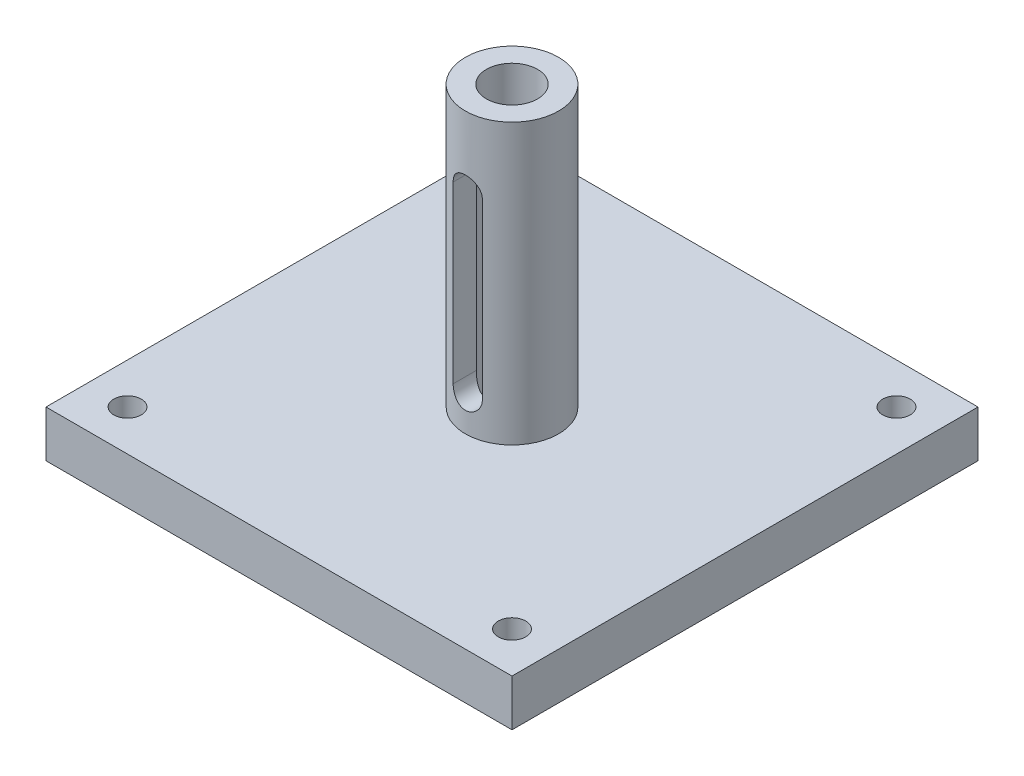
ISO-10303-21;
HEADER;
FILE_DESCRIPTION(('STEP AP214'),'2;1');
FILE_NAME('part.step','',(''),(''),'','','');
FILE_SCHEMA(('AUTOMOTIVE_DESIGN { 1 0 10303 214 1 1 1 1 }'));
ENDSEC;
DATA;
#1=APPLICATION_CONTEXT('core data for automotive mechanical design processes');
#2=APPLICATION_PROTOCOL_DEFINITION('international standard','automotive_design',2000,#1);
#3=PRODUCT_CONTEXT('',#1,'mechanical');
#4=PRODUCT('Part','Part','',(#3));
#5=PRODUCT_RELATED_PRODUCT_CATEGORY('part','',(#4));
#6=PRODUCT_DEFINITION_FORMATION('','',#4);
#7=PRODUCT_DEFINITION_CONTEXT('part definition',#1,'design');
#8=PRODUCT_DEFINITION('design','',#6,#7);
#9=PRODUCT_DEFINITION_SHAPE('','',#8);
#10=(LENGTH_UNIT() NAMED_UNIT(*) SI_UNIT(.MILLI.,.METRE.));
#11=(NAMED_UNIT(*) PLANE_ANGLE_UNIT() SI_UNIT($,.RADIAN.));
#12=(NAMED_UNIT(*) SI_UNIT($,.STERADIAN.) SOLID_ANGLE_UNIT());
#13=UNCERTAINTY_MEASURE_WITH_UNIT(LENGTH_MEASURE(1.E-05),#10,'distance_accuracy_value','');
#14=(GEOMETRIC_REPRESENTATION_CONTEXT(3) GLOBAL_UNCERTAINTY_ASSIGNED_CONTEXT((#13)) GLOBAL_UNIT_ASSIGNED_CONTEXT((#10,
#11,#12)) REPRESENTATION_CONTEXT('',''));
#15=CARTESIAN_POINT('',(0.,0.,0.));
#16=DIRECTION('',(0.,0.,1.));
#17=DIRECTION('',(1.,0.,0.));
#18=AXIS2_PLACEMENT_3D('',#15,#16,#17);
#19=CARTESIAN_POINT('',(25.4,5.08,25.4));
#20=DIRECTION('',(-1.,0.,0.));
#21=DIRECTION('',(0.,0.,1.));
#22=AXIS2_PLACEMENT_3D('',#19,#20,#21);
#23=PLANE('',#22);
#24=DIRECTION('',(0.,0.,-1.));
#25=VECTOR('',#24,1.);
#26=CARTESIAN_POINT('',(25.4,0.,25.4));
#27=LINE('',#26,#25);
#28=CARTESIAN_POINT('',(25.4,0.,25.4));
#29=VERTEX_POINT('',#28);
#30=CARTESIAN_POINT('',(25.4,0.,-25.4));
#31=VERTEX_POINT('',#30);
#32=EDGE_CURVE('E273',#29,#31,#27,.T.);
#33=ORIENTED_EDGE('',*,*,#32,.T.);
#34=DIRECTION('',(0.,-1.,0.));
#35=VECTOR('',#34,1.);
#36=CARTESIAN_POINT('',(25.4,5.08,-25.4));
#37=LINE('',#36,#35);
#38=CARTESIAN_POINT('',(25.4,5.08,-25.4));
#39=VERTEX_POINT('',#38);
#40=EDGE_CURVE('E251',#39,#31,#37,.T.);
#41=ORIENTED_EDGE('',*,*,#40,.F.);
#42=DIRECTION('',(0.,0.,-1.));
#43=VECTOR('',#42,1.);
#44=CARTESIAN_POINT('',(25.4,5.08,25.4));
#45=LINE('',#44,#43);
#46=CARTESIAN_POINT('',(25.4,5.08,25.4));
#47=VERTEX_POINT('',#46);
#48=EDGE_CURVE('E268',#47,#39,#45,.T.);
#49=ORIENTED_EDGE('',*,*,#48,.F.);
#50=DIRECTION('',(0.,-1.,0.));
#51=VECTOR('',#50,1.);
#52=CARTESIAN_POINT('',(25.4,5.08,25.4));
#53=LINE('',#52,#51);
#54=EDGE_CURVE('E262',#47,#29,#53,.T.);
#55=ORIENTED_EDGE('',*,*,#54,.T.);
#56=EDGE_LOOP('',(#33,#41,#49,#55));
#57=FACE_BOUND('',#56,.T.);
#58=ADVANCED_FACE('F39',(#57),#23,.F.);
#59=CARTESIAN_POINT('',(-25.4,5.08,-25.4));
#60=DIRECTION('',(0.,0.,1.));
#61=DIRECTION('',(1.,0.,0.));
#62=AXIS2_PLACEMENT_3D('',#59,#60,#61);
#63=PLANE('',#62);
#64=DIRECTION('',(-1.,0.,0.));
#65=VECTOR('',#64,1.);
#66=CARTESIAN_POINT('',(-25.4,0.,-25.4));
#67=LINE('',#66,#65);
#68=CARTESIAN_POINT('',(-25.4,0.,-25.4));
#69=VERTEX_POINT('',#68);
#70=EDGE_CURVE('E271',#31,#69,#67,.T.);
#71=ORIENTED_EDGE('',*,*,#70,.T.);
#72=DIRECTION('',(0.,-1.,0.));
#73=VECTOR('',#72,1.);
#74=CARTESIAN_POINT('',(-25.4,5.08,-25.4));
#75=LINE('',#74,#73);
#76=CARTESIAN_POINT('',(-25.4,5.08,-25.4));
#77=VERTEX_POINT('',#76);
#78=EDGE_CURVE('E256',#77,#69,#75,.T.);
#79=ORIENTED_EDGE('',*,*,#78,.F.);
#80=DIRECTION('',(-1.,0.,0.));
#81=VECTOR('',#80,1.);
#82=CARTESIAN_POINT('',(-25.4,5.08,-25.4));
#83=LINE('',#82,#81);
#84=EDGE_CURVE('E280',#39,#77,#83,.T.);
#85=ORIENTED_EDGE('',*,*,#84,.F.);
#86=ORIENTED_EDGE('',*,*,#40,.T.);
#87=EDGE_LOOP('',(#71,#79,#85,#86));
#88=FACE_BOUND('',#87,.T.);
#89=ADVANCED_FACE('F302',(#88),#63,.F.);
#90=CARTESIAN_POINT('',(-25.4,5.08,25.4));
#91=DIRECTION('',(1.,0.,0.));
#92=DIRECTION('',(0.,0.,-1.));
#93=AXIS2_PLACEMENT_3D('',#90,#91,#92);
#94=PLANE('',#93);
#95=DIRECTION('',(0.,0.,1.));
#96=VECTOR('',#95,1.);
#97=CARTESIAN_POINT('',(-25.4,0.,25.4));
#98=LINE('',#97,#96);
#99=CARTESIAN_POINT('',(-25.4,0.,25.4));
#100=VERTEX_POINT('',#99);
#101=EDGE_CURVE('E269',#69,#100,#98,.T.);
#102=ORIENTED_EDGE('',*,*,#101,.T.);
#103=DIRECTION('',(0.,-1.,0.));
#104=VECTOR('',#103,1.);
#105=CARTESIAN_POINT('',(-25.4,5.08,25.4));
#106=LINE('',#105,#104);
#107=CARTESIAN_POINT('',(-25.4,5.08,25.4));
#108=VERTEX_POINT('',#107);
#109=EDGE_CURVE('E259',#108,#100,#106,.T.);
#110=ORIENTED_EDGE('',*,*,#109,.F.);
#111=DIRECTION('',(0.,0.,1.));
#112=VECTOR('',#111,1.);
#113=CARTESIAN_POINT('',(-25.4,5.08,25.4));
#114=LINE('',#113,#112);
#115=EDGE_CURVE('E278',#77,#108,#114,.T.);
#116=ORIENTED_EDGE('',*,*,#115,.F.);
#117=ORIENTED_EDGE('',*,*,#78,.T.);
#118=EDGE_LOOP('',(#102,#110,#116,#117));
#119=FACE_BOUND('',#118,.T.);
#120=ADVANCED_FACE('F307',(#119),#94,.F.);
#121=CARTESIAN_POINT('',(-25.4,5.08,25.4));
#122=DIRECTION('',(0.,0.,-1.));
#123=DIRECTION('',(-1.,0.,0.));
#124=AXIS2_PLACEMENT_3D('',#121,#122,#123);
#125=PLANE('',#124);
#126=DIRECTION('',(1.,0.,0.));
#127=VECTOR('',#126,1.);
#128=CARTESIAN_POINT('',(-25.4,0.,25.4));
#129=LINE('',#128,#127);
#130=EDGE_CURVE('E266',#100,#29,#129,.T.);
#131=ORIENTED_EDGE('',*,*,#130,.T.);
#132=ORIENTED_EDGE('',*,*,#54,.F.);
#133=DIRECTION('',(1.,0.,0.));
#134=VECTOR('',#133,1.);
#135=CARTESIAN_POINT('',(-25.4,5.08,25.4));
#136=LINE('',#135,#134);
#137=EDGE_CURVE('E265',#108,#47,#136,.T.);
#138=ORIENTED_EDGE('',*,*,#137,.F.);
#139=ORIENTED_EDGE('',*,*,#109,.T.);
#140=EDGE_LOOP('',(#131,#132,#138,#139));
#141=FACE_BOUND('',#140,.T.);
#142=ADVANCED_FACE('F322',(#141),#125,.F.);
#143=CARTESIAN_POINT('',(0.,5.08,0.));
#144=DIRECTION('',(0.,-1.,0.));
#145=DIRECTION('',(0.,0.,-1.));
#146=AXIS2_PLACEMENT_3D('',#143,#144,#145);
#147=PLANE('',#146);
#148=CARTESIAN_POINT('',(20.955,5.08,-20.955));
#149=DIRECTION('',(0.,1.,0.));
#150=DIRECTION('',(0.,0.,1.));
#151=AXIS2_PLACEMENT_3D('',#148,#149,#150);
#152=CIRCLE('',#151,1.49987);
#153=CARTESIAN_POINT('',(20.955,5.08,-19.45513));
#154=VERTEX_POINT('',#153);
#155=EDGE_CURVE('E523',#154,#154,#152,.T.);
#156=ORIENTED_EDGE('',*,*,#155,.F.);
#157=EDGE_LOOP('',(#156));
#158=FACE_BOUND('',#157,.T.);
#159=CARTESIAN_POINT('',(-20.955,5.08,20.955));
#160=DIRECTION('',(0.,1.,0.));
#161=DIRECTION('',(0.,0.,1.));
#162=AXIS2_PLACEMENT_3D('',#159,#160,#161);
#163=CIRCLE('',#162,1.49987);
#164=CARTESIAN_POINT('',(-20.955,5.08,22.45487));
#165=VERTEX_POINT('',#164);
#166=EDGE_CURVE('E528',#165,#165,#163,.T.);
#167=ORIENTED_EDGE('',*,*,#166,.F.);
#168=EDGE_LOOP('',(#167));
#169=FACE_BOUND('',#168,.T.);
#170=CARTESIAN_POINT('',(20.955,5.08,20.955));
#171=DIRECTION('',(0.,1.,0.));
#172=DIRECTION('',(0.,0.,1.));
#173=AXIS2_PLACEMENT_3D('',#170,#171,#172);
#174=CIRCLE('',#173,1.49987);
#175=CARTESIAN_POINT('',(20.955,5.08,22.45487));
#176=VERTEX_POINT('',#175);
#177=EDGE_CURVE('E544',#176,#176,#174,.T.);
#178=ORIENTED_EDGE('',*,*,#177,.F.);
#179=EDGE_LOOP('',(#178));
#180=FACE_BOUND('',#179,.T.);
#181=CARTESIAN_POINT('',(-20.955,5.08,-20.955));
#182=DIRECTION('',(0.,1.,0.));
#183=DIRECTION('',(0.,0.,1.));
#184=AXIS2_PLACEMENT_3D('',#181,#182,#183);
#185=CIRCLE('',#184,1.49987);
#186=CARTESIAN_POINT('',(-20.955,5.08,-19.45513));
#187=VERTEX_POINT('',#186);
#188=EDGE_CURVE('E357',#187,#187,#185,.T.);
#189=ORIENTED_EDGE('',*,*,#188,.F.);
#190=EDGE_LOOP('',(#189));
#191=FACE_BOUND('',#190,.T.);
#192=CARTESIAN_POINT('',(0.,5.08,0.));
#193=DIRECTION('',(0.,-1.,0.));
#194=DIRECTION('',(0.,0.,-1.));
#195=AXIS2_PLACEMENT_3D('',#192,#193,#194);
#196=CIRCLE('',#195,5.08);
#197=CARTESIAN_POINT('',(0.,5.08,-5.08));
#198=VERTEX_POINT('',#197);
#199=EDGE_CURVE('E249',#198,#198,#196,.F.);
#200=ORIENTED_EDGE('',*,*,#199,.F.);
#201=EDGE_LOOP('',(#200));
#202=FACE_BOUND('',#201,.T.);
#203=ORIENTED_EDGE('',*,*,#48,.T.);
#204=ORIENTED_EDGE('',*,*,#84,.T.);
#205=ORIENTED_EDGE('',*,*,#115,.T.);
#206=ORIENTED_EDGE('',*,*,#137,.T.);
#207=EDGE_LOOP('',(#203,#204,#205,#206));
#208=FACE_BOUND('',#207,.T.);
#209=ADVANCED_FACE('F205',(#158,#169,#180,#191,#202,#208),#147,.F.);
#210=CARTESIAN_POINT('',(0.,0.,0.));
#211=DIRECTION('',(0.,-1.,0.));
#212=DIRECTION('',(0.,0.,-1.));
#213=AXIS2_PLACEMENT_3D('',#210,#211,#212);
#214=PLANE('',#213);
#215=CARTESIAN_POINT('',(20.955,0.,-20.955));
#216=DIRECTION('',(0.,1.,0.));
#217=DIRECTION('',(0.,0.,1.));
#218=AXIS2_PLACEMENT_3D('',#215,#216,#217);
#219=CIRCLE('',#218,1.49987);
#220=CARTESIAN_POINT('',(20.955,0.,-19.45513));
#221=VERTEX_POINT('',#220);
#222=EDGE_CURVE('E521',#221,#221,#219,.T.);
#223=ORIENTED_EDGE('',*,*,#222,.T.);
#224=EDGE_LOOP('',(#223));
#225=FACE_BOUND('',#224,.T.);
#226=CARTESIAN_POINT('',(-20.955,0.,20.955));
#227=DIRECTION('',(0.,1.,0.));
#228=DIRECTION('',(0.,0.,1.));
#229=AXIS2_PLACEMENT_3D('',#226,#227,#228);
#230=CIRCLE('',#229,1.49987);
#231=CARTESIAN_POINT('',(-20.955,0.,22.45487));
#232=VERTEX_POINT('',#231);
#233=EDGE_CURVE('E524',#232,#232,#230,.T.);
#234=ORIENTED_EDGE('',*,*,#233,.T.);
#235=EDGE_LOOP('',(#234));
#236=FACE_BOUND('',#235,.T.);
#237=CARTESIAN_POINT('',(20.955,0.,20.955));
#238=DIRECTION('',(0.,1.,0.));
#239=DIRECTION('',(0.,0.,1.));
#240=AXIS2_PLACEMENT_3D('',#237,#238,#239);
#241=CIRCLE('',#240,1.49987);
#242=CARTESIAN_POINT('',(20.955,0.,22.45487));
#243=VERTEX_POINT('',#242);
#244=EDGE_CURVE('E533',#243,#243,#241,.T.);
#245=ORIENTED_EDGE('',*,*,#244,.T.);
#246=EDGE_LOOP('',(#245));
#247=FACE_BOUND('',#246,.T.);
#248=CARTESIAN_POINT('',(-20.955,0.,-20.955));
#249=DIRECTION('',(0.,1.,0.));
#250=DIRECTION('',(0.,0.,1.));
#251=AXIS2_PLACEMENT_3D('',#248,#249,#250);
#252=CIRCLE('',#251,1.49987);
#253=CARTESIAN_POINT('',(-20.955,0.,-19.45513));
#254=VERTEX_POINT('',#253);
#255=EDGE_CURVE('E352',#254,#254,#252,.T.);
#256=ORIENTED_EDGE('',*,*,#255,.T.);
#257=EDGE_LOOP('',(#256));
#258=FACE_BOUND('',#257,.T.);
#259=CARTESIAN_POINT('',(0.,0.,0.));
#260=DIRECTION('',(0.,1.,0.));
#261=DIRECTION('',(0.,0.,1.));
#262=AXIS2_PLACEMENT_3D('',#259,#260,#261);
#263=CIRCLE('',#262,1.5875);
#264=CARTESIAN_POINT('',(0.,0.,1.5875));
#265=VERTEX_POINT('',#264);
#266=EDGE_CURVE('E351',#265,#265,#263,.T.);
#267=ORIENTED_EDGE('',*,*,#266,.T.);
#268=EDGE_LOOP('',(#267));
#269=FACE_BOUND('',#268,.T.);
#270=ORIENTED_EDGE('',*,*,#32,.F.);
#271=ORIENTED_EDGE('',*,*,#130,.F.);
#272=ORIENTED_EDGE('',*,*,#101,.F.);
#273=ORIENTED_EDGE('',*,*,#70,.F.);
#274=EDGE_LOOP('',(#270,#271,#272,#273));
#275=FACE_BOUND('',#274,.T.);
#276=ADVANCED_FACE('F295',(#225,#236,#247,#258,#269,#275),#214,.T.);
#277=CARTESIAN_POINT('',(0.,35.56,0.));
#278=DIRECTION('',(0.,1.,0.));
#279=DIRECTION('',(0.,0.,1.));
#280=AXIS2_PLACEMENT_3D('',#277,#278,#279);
#281=PLANE('',#280);
#282=CARTESIAN_POINT('',(0.,35.56,0.));
#283=DIRECTION('',(0.,1.,0.));
#284=DIRECTION('',(0.,0.,1.));
#285=AXIS2_PLACEMENT_3D('',#282,#283,#284);
#286=CIRCLE('',#285,5.08);
#287=CARTESIAN_POINT('',(0.,35.56,5.08));
#288=VERTEX_POINT('',#287);
#289=EDGE_CURVE('E276',#288,#288,#286,.T.);
#290=ORIENTED_EDGE('',*,*,#289,.T.);
#291=EDGE_LOOP('',(#290));
#292=FACE_BOUND('',#291,.T.);
#293=CARTESIAN_POINT('',(0.,35.56,0.));
#294=DIRECTION('',(0.,1.,0.));
#295=DIRECTION('',(0.,0.,1.));
#296=AXIS2_PLACEMENT_3D('',#293,#294,#295);
#297=CIRCLE('',#296,2.794);
#298=CARTESIAN_POINT('',(0.,35.56,2.794));
#299=VERTEX_POINT('',#298);
#300=EDGE_CURVE('E286',#299,#299,#297,.T.);
#301=ORIENTED_EDGE('',*,*,#300,.F.);
#302=EDGE_LOOP('',(#301));
#303=FACE_BOUND('',#302,.T.);
#304=ADVANCED_FACE('F203',(#292,#303),#281,.T.);
#305=CARTESIAN_POINT('',(0.,35.56,0.));
#306=DIRECTION('',(0.,-1.,0.));
#307=DIRECTION('',(0.,0.,-1.));
#308=AXIS2_PLACEMENT_3D('',#305,#306,#307);
#309=CYLINDRICAL_SURFACE('',#308,5.08);
#310=DIRECTION('',(0.,-1.,0.));
#311=VECTOR('',#310,1.);
#312=CARTESIAN_POINT('',(1.5875,35.56,-4.82558221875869));
#313=LINE('',#312,#311);
#314=CARTESIAN_POINT('',(1.5875,8.89,-4.82558221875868));
#315=VERTEX_POINT('',#314);
#316=CARTESIAN_POINT('',(1.5875,27.94,-4.82558221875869));
#317=VERTEX_POINT('',#316);
#318=EDGE_CURVE('E378',#315,#317,#313,.F.);
#319=ORIENTED_EDGE('',*,*,#318,.T.);
#320=CARTESIAN_POINT('',(1.5875,27.94,-4.82558221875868));
#321=CARTESIAN_POINT('',(1.58750100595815,27.9834881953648,-4.82557828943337));
#322=CARTESIAN_POINT('',(1.58571187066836,28.0269543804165,-4.82617083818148));
#323=CARTESIAN_POINT('',(1.57858282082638,28.1135530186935,-4.82850881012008));
#324=CARTESIAN_POINT('',(1.57324376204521,28.1566855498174,-4.83025395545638));
#325=CARTESIAN_POINT('',(1.55199520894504,28.2848746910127,-4.83714223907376));
#326=CARTESIAN_POINT('',(1.53085384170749,28.3690365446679,-4.84393879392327));
#327=CARTESIAN_POINT('',(1.47536034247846,28.5323846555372,-4.86112567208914));
#328=CARTESIAN_POINT('',(1.4410137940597,28.6115729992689,-4.87151447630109));
#329=CARTESIAN_POINT('',(1.36014702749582,28.7631253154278,-4.89470782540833));
#330=CARTESIAN_POINT('',(1.31362048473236,28.8354857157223,-4.90751362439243));
#331=CARTESIAN_POINT('',(1.20801981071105,28.9737530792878,-4.93458638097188));
#332=CARTESIAN_POINT('',(1.14860184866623,29.0393909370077,-4.94888629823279));
#333=CARTESIAN_POINT('',(1.01963707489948,29.1599548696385,-4.97705647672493));
#334=CARTESIAN_POINT('',(0.950088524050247,29.2148791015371,-4.99092666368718));
#335=CARTESIAN_POINT('',(0.800893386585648,29.3136471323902,-5.01705339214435));
#336=CARTESIAN_POINT('',(0.721053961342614,29.3572121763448,-5.0292663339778));
#337=CARTESIAN_POINT('',(0.554737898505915,29.4301887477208,-5.05031476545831));
#338=CARTESIAN_POINT('',(0.468263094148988,29.4596041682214,-5.05915118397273));
#339=CARTESIAN_POINT('',(0.293960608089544,29.5025457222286,-5.07221706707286));
#340=CARTESIAN_POINT('',(0.206257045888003,29.5165342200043,-5.0765802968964));
#341=CARTESIAN_POINT('',(0.0296446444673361,29.5296899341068,-5.08068067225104));
#342=CARTESIAN_POINT('',(-0.0592639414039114,29.5288602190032,-5.08041877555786));
#343=CARTESIAN_POINT('',(-0.232505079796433,29.5127066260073,-5.07539136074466));
#344=CARTESIAN_POINT('',(-0.31688963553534,29.4978842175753,-5.07078166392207));
#345=CARTESIAN_POINT('',(-0.481906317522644,29.4549890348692,-5.0577683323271));
#346=CARTESIAN_POINT('',(-0.562538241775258,29.4269155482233,-5.04936449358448));
#347=CARTESIAN_POINT('',(-0.718919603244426,29.3579926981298,-5.02949788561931));
#348=CARTESIAN_POINT('',(-0.794597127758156,29.3169910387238,-5.01799890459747));
#349=CARTESIAN_POINT('',(-0.938152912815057,29.2234980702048,-4.99315374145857));
#350=CARTESIAN_POINT('',(-1.00602927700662,29.1710039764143,-4.97980711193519));
#351=CARTESIAN_POINT('',(-1.1350408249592,29.0534482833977,-4.95203191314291));
#352=CARTESIAN_POINT('',(-1.19577830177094,28.9879548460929,-4.93758143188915));
#353=CARTESIAN_POINT('',(-1.3055380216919,28.8475608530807,-4.90970330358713));
#354=CARTESIAN_POINT('',(-1.35455673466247,28.7726574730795,-4.89627596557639));
#355=CARTESIAN_POINT('',(-1.43995728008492,28.6144316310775,-4.87185035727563));
#356=CARTESIAN_POINT('',(-1.47618467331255,28.5310209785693,-4.86088232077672));
#357=CARTESIAN_POINT('',(-1.53391179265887,28.3589019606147,-4.84297872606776));
#358=CARTESIAN_POINT('',(-1.55543427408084,28.270202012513,-4.83603693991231));
#359=CARTESIAN_POINT('',(-1.57529747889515,28.1405488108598,-4.8295828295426));
#360=CARTESIAN_POINT('',(-1.57987242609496,28.1005629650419,-4.82808623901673));
#361=CARTESIAN_POINT('',(-1.58597120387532,28.0203916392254,-4.82608561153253));
#362=CARTESIAN_POINT('',(-1.58749934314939,27.9802065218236,-4.8255801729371));
#363=CARTESIAN_POINT('',(-1.5875,27.94,-4.82558221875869));
#364=B_SPLINE_CURVE_WITH_KNOTS('',3,(#320,#321,#322,#323,#324,#325,#326,#327,#328,#329,#330,
#331,#332,#333,#334,#335,#336,#337,#338,#339,#340,#341,#342,#343,#344,#345,#346,#347,#348,#349,
#350,#351,#352,#353,#354,#355,#356,#357,#358,#359,#360,#361,#362,#363),.UNSPECIFIED.,.F.,.F.,(4,
2,2,2,2,2,2,2,2,2,2,2,2,2,2,2,2,2,2,2,2,4),(0.,0.130380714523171,0.260730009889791,
0.520499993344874,0.780160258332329,1.03995562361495,1.30779302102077,1.57567645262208,
1.84961966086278,2.12348745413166,2.38890301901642,2.65426362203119,2.91046138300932,
3.16667291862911,3.42602313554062,3.68543626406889,3.95563699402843,4.22591901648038,
4.49936093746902,4.77237875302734,4.89309476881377,5.01363995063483),.UNSPECIFIED.);
#365=CARTESIAN_POINT('',(-1.5875,27.94,-4.82558221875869));
#366=VERTEX_POINT('',#365);
#367=EDGE_CURVE('E212',#317,#366,#364,.T.);
#368=ORIENTED_EDGE('',*,*,#367,.T.);
#369=DIRECTION('',(0.,-1.,0.));
#370=VECTOR('',#369,1.);
#371=CARTESIAN_POINT('',(-1.5875,35.56,-4.82558221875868));
#372=LINE('',#371,#370);
#373=CARTESIAN_POINT('',(-1.5875,8.89,-4.82558221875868));
#374=VERTEX_POINT('',#373);
#375=EDGE_CURVE('E192',#366,#374,#372,.T.);
#376=ORIENTED_EDGE('',*,*,#375,.T.);
#377=CARTESIAN_POINT('',(-1.5875,8.89,-4.82558221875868));
#378=CARTESIAN_POINT('',(-1.58750100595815,8.84651180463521,-4.82557828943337));
#379=CARTESIAN_POINT('',(-1.58571187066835,8.80304561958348,-4.82617083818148));
#380=CARTESIAN_POINT('',(-1.57858282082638,8.71644698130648,-4.82850881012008));
#381=CARTESIAN_POINT('',(-1.57324376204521,8.67331445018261,-4.83025395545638));
#382=CARTESIAN_POINT('',(-1.55199520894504,8.54512530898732,-4.83714223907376));
#383=CARTESIAN_POINT('',(-1.53085384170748,8.46096345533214,-4.84393879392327));
#384=CARTESIAN_POINT('',(-1.47536034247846,8.29761534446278,-4.86112567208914));
#385=CARTESIAN_POINT('',(-1.44101379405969,8.21842700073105,-4.87151447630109));
#386=CARTESIAN_POINT('',(-1.36014702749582,8.06687468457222,-4.89470782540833));
#387=CARTESIAN_POINT('',(-1.31362048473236,7.99451428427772,-4.90751362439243));
#388=CARTESIAN_POINT('',(-1.20801981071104,7.85624692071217,-4.93458638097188));
#389=CARTESIAN_POINT('',(-1.14860184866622,7.7906090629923,-4.94888629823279));
#390=CARTESIAN_POINT('',(-1.01963707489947,7.6700451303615,-4.97705647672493));
#391=CARTESIAN_POINT('',(-0.95008852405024,7.61512089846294,-4.99092666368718));
#392=CARTESIAN_POINT('',(-0.800893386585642,7.51635286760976,-5.01705339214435));
#393=CARTESIAN_POINT('',(-0.721053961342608,7.47278782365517,-5.0292663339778));
#394=CARTESIAN_POINT('',(-0.554737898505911,7.39981125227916,-5.05031476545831));
#395=CARTESIAN_POINT('',(-0.468263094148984,7.37039583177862,-5.05915118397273));
#396=CARTESIAN_POINT('',(-0.293960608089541,7.32745427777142,-5.07221706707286));
#397=CARTESIAN_POINT('',(-0.206257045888,7.31346577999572,-5.0765802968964));
#398=CARTESIAN_POINT('',(-0.0296446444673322,7.30031006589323,-5.08068067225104));
#399=CARTESIAN_POINT('',(0.0592639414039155,7.30113978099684,-5.08041877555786));
#400=CARTESIAN_POINT('',(0.232505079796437,7.31729337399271,-5.07539136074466));
#401=CARTESIAN_POINT('',(0.316889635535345,7.33211578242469,-5.07078166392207));
#402=CARTESIAN_POINT('',(0.481906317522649,7.37501096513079,-5.0577683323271));
#403=CARTESIAN_POINT('',(0.562538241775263,7.40308445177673,-5.04936449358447));
#404=CARTESIAN_POINT('',(0.718919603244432,7.4720073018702,-5.02949788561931));
#405=CARTESIAN_POINT('',(0.794597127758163,7.51300896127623,-5.01799890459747));
#406=CARTESIAN_POINT('',(0.938152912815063,7.60650192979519,-4.99315374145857));
#407=CARTESIAN_POINT('',(1.00602927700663,7.65899602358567,-4.97980711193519));
#408=CARTESIAN_POINT('',(1.13504082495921,7.77655171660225,-4.95203191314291));
#409=CARTESIAN_POINT('',(1.19577830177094,7.84204515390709,-4.93758143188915));
#410=CARTESIAN_POINT('',(1.3055380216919,7.98243914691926,-4.90970330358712));
#411=CARTESIAN_POINT('',(1.35455673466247,8.05734252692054,-4.89627596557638));
#412=CARTESIAN_POINT('',(1.43995728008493,8.21556836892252,-4.87185035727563));
#413=CARTESIAN_POINT('',(1.47618467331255,8.29897902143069,-4.86088232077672));
#414=CARTESIAN_POINT('',(1.53391179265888,8.4710980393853,-4.84297872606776));
#415=CARTESIAN_POINT('',(1.55543427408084,8.55979798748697,-4.83603693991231));
#416=CARTESIAN_POINT('',(1.57529747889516,8.68945118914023,-4.8295828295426));
#417=CARTESIAN_POINT('',(1.57987242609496,8.72943703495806,-4.82808623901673));
#418=CARTESIAN_POINT('',(1.58597120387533,8.8096083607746,-4.82608561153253));
#419=CARTESIAN_POINT('',(1.5874993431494,8.84979347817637,-4.8255801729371));
#420=CARTESIAN_POINT('',(1.5875,8.89,-4.82558221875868));
#421=B_SPLINE_CURVE_WITH_KNOTS('',3,(#377,#378,#379,#380,#381,#382,#383,#384,#385,#386,#387,
#388,#389,#390,#391,#392,#393,#394,#395,#396,#397,#398,#399,#400,#401,#402,#403,#404,#405,#406,
#407,#408,#409,#410,#411,#412,#413,#414,#415,#416,#417,#418,#419,#420),.UNSPECIFIED.,.F.,.F.,(4,
2,2,2,2,2,2,2,2,2,2,2,2,2,2,2,2,2,2,2,2,4),(0.,0.130380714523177,0.260730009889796,
0.520499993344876,0.780160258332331,1.03995562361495,1.30779302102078,1.57567645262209,
1.84961966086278,2.12348745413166,2.38890301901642,2.65426362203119,2.91046138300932,
3.16667291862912,3.42602313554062,3.68543626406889,3.95563699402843,4.22591901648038,
4.49936093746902,4.77237875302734,4.89309476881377,5.01363995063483),.UNSPECIFIED.);
#422=EDGE_CURVE('E146',#374,#315,#421,.T.);
#423=ORIENTED_EDGE('',*,*,#422,.T.);
#424=EDGE_LOOP('',(#319,#368,#376,#423));
#425=FACE_BOUND('',#424,.T.);
#426=DIRECTION('',(0.,-1.,0.));
#427=VECTOR('',#426,1.);
#428=CARTESIAN_POINT('',(-1.5875,35.56,4.82558221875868));
#429=LINE('',#428,#427);
#430=CARTESIAN_POINT('',(-1.5875,8.89,4.82558221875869));
#431=VERTEX_POINT('',#430);
#432=CARTESIAN_POINT('',(-1.5875,27.94,4.82558221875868));
#433=VERTEX_POINT('',#432);
#434=EDGE_CURVE('E367',#431,#433,#429,.F.);
#435=ORIENTED_EDGE('',*,*,#434,.T.);
#436=CARTESIAN_POINT('',(-1.5875,27.94,4.82558221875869));
#437=CARTESIAN_POINT('',(-1.58750100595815,27.9834881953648,4.82557828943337));
#438=CARTESIAN_POINT('',(-1.58571187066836,28.0269543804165,4.82617083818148));
#439=CARTESIAN_POINT('',(-1.57858282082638,28.1135530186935,4.82850881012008));
#440=CARTESIAN_POINT('',(-1.57324376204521,28.1566855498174,4.83025395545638));
#441=CARTESIAN_POINT('',(-1.55199520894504,28.2848746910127,4.83714223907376));
#442=CARTESIAN_POINT('',(-1.53085384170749,28.3690365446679,4.84393879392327));
#443=CARTESIAN_POINT('',(-1.47536034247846,28.5323846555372,4.86112567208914));
#444=CARTESIAN_POINT('',(-1.44101379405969,28.6115729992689,4.87151447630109));
#445=CARTESIAN_POINT('',(-1.36014702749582,28.7631253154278,4.89470782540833));
#446=CARTESIAN_POINT('',(-1.31362048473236,28.8354857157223,4.90751362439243));
#447=CARTESIAN_POINT('',(-1.20801981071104,28.9737530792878,4.93458638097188));
#448=CARTESIAN_POINT('',(-1.14860184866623,29.0393909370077,4.94888629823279));
#449=CARTESIAN_POINT('',(-1.01963707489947,29.1599548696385,4.97705647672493));
#450=CARTESIAN_POINT('',(-0.950088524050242,29.2148791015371,4.99092666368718));
#451=CARTESIAN_POINT('',(-0.800893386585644,29.3136471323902,5.01705339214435));
#452=CARTESIAN_POINT('',(-0.721053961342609,29.3572121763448,5.0292663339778));
#453=CARTESIAN_POINT('',(-0.554737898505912,29.4301887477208,5.05031476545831));
#454=CARTESIAN_POINT('',(-0.468263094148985,29.4596041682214,5.05915118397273));
#455=CARTESIAN_POINT('',(-0.293960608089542,29.5025457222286,5.07221706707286));
#456=CARTESIAN_POINT('',(-0.206257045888,29.5165342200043,5.0765802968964));
#457=CARTESIAN_POINT('',(-0.0296446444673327,29.5296899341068,5.08068067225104));
#458=CARTESIAN_POINT('',(0.0592639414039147,29.5288602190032,5.08041877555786));
#459=CARTESIAN_POINT('',(0.232505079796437,29.5127066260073,5.07539136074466));
#460=CARTESIAN_POINT('',(0.316889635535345,29.4978842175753,5.07078166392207));
#461=CARTESIAN_POINT('',(0.481906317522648,29.4549890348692,5.0577683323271));
#462=CARTESIAN_POINT('',(0.562538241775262,29.4269155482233,5.04936449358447));
#463=CARTESIAN_POINT('',(0.718919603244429,29.3579926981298,5.02949788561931));
#464=CARTESIAN_POINT('',(0.79459712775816,29.3169910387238,5.01799890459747));
#465=CARTESIAN_POINT('',(0.93815291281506,29.2234980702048,4.99315374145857));
#466=CARTESIAN_POINT('',(1.00602927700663,29.1710039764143,4.97980711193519));
#467=CARTESIAN_POINT('',(1.1350408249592,29.0534482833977,4.95203191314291));
#468=CARTESIAN_POINT('',(1.19577830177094,28.9879548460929,4.93758143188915));
#469=CARTESIAN_POINT('',(1.3055380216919,28.8475608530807,4.90970330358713));
#470=CARTESIAN_POINT('',(1.35455673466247,28.7726574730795,4.89627596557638));
#471=CARTESIAN_POINT('',(1.43995728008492,28.6144316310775,4.87185035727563));
#472=CARTESIAN_POINT('',(1.47618467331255,28.5310209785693,4.86088232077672));
#473=CARTESIAN_POINT('',(1.53391179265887,28.3589019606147,4.84297872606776));
#474=CARTESIAN_POINT('',(1.55543427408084,28.270202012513,4.83603693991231));
#475=CARTESIAN_POINT('',(1.57529747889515,28.1405488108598,4.8295828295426));
#476=CARTESIAN_POINT('',(1.57987242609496,28.1005629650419,4.82808623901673));
#477=CARTESIAN_POINT('',(1.58597120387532,28.0203916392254,4.82608561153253));
#478=CARTESIAN_POINT('',(1.58749934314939,27.9802065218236,4.8255801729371));
#479=CARTESIAN_POINT('',(1.5875,27.94,4.82558221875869));
#480=B_SPLINE_CURVE_WITH_KNOTS('',3,(#436,#437,#438,#439,#440,#441,#442,#443,#444,#445,#446,
#447,#448,#449,#450,#451,#452,#453,#454,#455,#456,#457,#458,#459,#460,#461,#462,#463,#464,#465,
#466,#467,#468,#469,#470,#471,#472,#473,#474,#475,#476,#477,#478,#479),.UNSPECIFIED.,.F.,.F.,(4,
2,2,2,2,2,2,2,2,2,2,2,2,2,2,2,2,2,2,2,2,4),(0.,0.130380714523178,0.260730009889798,
0.520499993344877,0.780160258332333,1.03995562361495,1.30779302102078,1.57567645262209,
1.84961966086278,2.12348745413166,2.38890301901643,2.65426362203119,2.91046138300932,
3.16667291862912,3.42602313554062,3.68543626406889,3.95563699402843,4.22591901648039,
4.49936093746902,4.77237875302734,4.89309476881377,5.01363995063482),.UNSPECIFIED.);
#481=CARTESIAN_POINT('',(1.5875,27.94,4.82558221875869));
#482=VERTEX_POINT('',#481);
#483=EDGE_CURVE('E219',#433,#482,#480,.T.);
#484=ORIENTED_EDGE('',*,*,#483,.T.);
#485=DIRECTION('',(0.,-1.,0.));
#486=VECTOR('',#485,1.);
#487=CARTESIAN_POINT('',(1.5875,35.56,4.82558221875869));
#488=LINE('',#487,#486);
#489=CARTESIAN_POINT('',(1.5875,8.89,4.82558221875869));
#490=VERTEX_POINT('',#489);
#491=EDGE_CURVE('E220',#482,#490,#488,.T.);
#492=ORIENTED_EDGE('',*,*,#491,.T.);
#493=CARTESIAN_POINT('',(1.5875,8.89,4.82558221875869));
#494=CARTESIAN_POINT('',(1.58750100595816,8.84651180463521,4.82557828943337));
#495=CARTESIAN_POINT('',(1.58571187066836,8.80304561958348,4.82617083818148));
#496=CARTESIAN_POINT('',(1.57858282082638,8.71644698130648,4.82850881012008));
#497=CARTESIAN_POINT('',(1.57324376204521,8.67331445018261,4.83025395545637));
#498=CARTESIAN_POINT('',(1.55199520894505,8.54512530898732,4.83714223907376));
#499=CARTESIAN_POINT('',(1.53085384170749,8.46096345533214,4.84393879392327));
#500=CARTESIAN_POINT('',(1.47536034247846,8.29761534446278,4.86112567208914));
#501=CARTESIAN_POINT('',(1.4410137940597,8.21842700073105,4.87151447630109));
#502=CARTESIAN_POINT('',(1.36014702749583,8.06687468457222,4.89470782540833));
#503=CARTESIAN_POINT('',(1.31362048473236,7.99451428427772,4.90751362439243));
#504=CARTESIAN_POINT('',(1.20801981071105,7.85624692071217,4.93458638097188));
#505=CARTESIAN_POINT('',(1.14860184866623,7.7906090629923,4.94888629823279));
#506=CARTESIAN_POINT('',(1.01963707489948,7.6700451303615,4.97705647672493));
#507=CARTESIAN_POINT('',(0.950088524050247,7.61512089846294,4.99092666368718));
#508=CARTESIAN_POINT('',(0.800893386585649,7.51635286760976,5.01705339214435));
#509=CARTESIAN_POINT('',(0.721053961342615,7.47278782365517,5.0292663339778));
#510=CARTESIAN_POINT('',(0.554737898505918,7.39981125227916,5.05031476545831));
#511=CARTESIAN_POINT('',(0.468263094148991,7.37039583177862,5.05915118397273));
#512=CARTESIAN_POINT('',(0.293960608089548,7.32745427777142,5.07221706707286));
#513=CARTESIAN_POINT('',(0.206257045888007,7.31346577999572,5.0765802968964));
#514=CARTESIAN_POINT('',(0.029644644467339,7.30031006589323,5.08068067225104));
#515=CARTESIAN_POINT('',(-0.0592639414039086,7.30113978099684,5.08041877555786));
#516=CARTESIAN_POINT('',(-0.232505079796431,7.31729337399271,5.07539136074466));
#517=CARTESIAN_POINT('',(-0.316889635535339,7.33211578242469,5.07078166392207));
#518=CARTESIAN_POINT('',(-0.481906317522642,7.37501096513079,5.0577683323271));
#519=CARTESIAN_POINT('',(-0.562538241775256,7.40308445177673,5.04936449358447));
#520=CARTESIAN_POINT('',(-0.718919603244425,7.4720073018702,5.02949788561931));
#521=CARTESIAN_POINT('',(-0.794597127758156,7.51300896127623,5.01799890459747));
#522=CARTESIAN_POINT('',(-0.938152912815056,7.60650192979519,4.99315374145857));
#523=CARTESIAN_POINT('',(-1.00602927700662,7.65899602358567,4.97980711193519));
#524=CARTESIAN_POINT('',(-1.1350408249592,7.77655171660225,4.95203191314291));
#525=CARTESIAN_POINT('',(-1.19577830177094,7.84204515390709,4.93758143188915));
#526=CARTESIAN_POINT('',(-1.3055380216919,7.98243914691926,4.90970330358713));
#527=CARTESIAN_POINT('',(-1.35455673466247,8.05734252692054,4.89627596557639));
#528=CARTESIAN_POINT('',(-1.43995728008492,8.21556836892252,4.87185035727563));
#529=CARTESIAN_POINT('',(-1.47618467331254,8.29897902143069,4.86088232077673));
#530=CARTESIAN_POINT('',(-1.53391179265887,8.4710980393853,4.84297872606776));
#531=CARTESIAN_POINT('',(-1.55543427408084,8.55979798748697,4.83603693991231));
#532=CARTESIAN_POINT('',(-1.57529747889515,8.68945118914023,4.8295828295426));
#533=CARTESIAN_POINT('',(-1.57987242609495,8.72943703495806,4.82808623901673));
#534=CARTESIAN_POINT('',(-1.58597120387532,8.8096083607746,4.82608561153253));
#535=CARTESIAN_POINT('',(-1.58749934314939,8.84979347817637,4.8255801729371));
#536=CARTESIAN_POINT('',(-1.5875,8.89,4.82558221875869));
#537=B_SPLINE_CURVE_WITH_KNOTS('',3,(#493,#494,#495,#496,#497,#498,#499,#500,#501,#502,#503,
#504,#505,#506,#507,#508,#509,#510,#511,#512,#513,#514,#515,#516,#517,#518,#519,#520,#521,#522,
#523,#524,#525,#526,#527,#528,#529,#530,#531,#532,#533,#534,#535,#536),.UNSPECIFIED.,.F.,.F.,(4,
2,2,2,2,2,2,2,2,2,2,2,2,2,2,2,2,2,2,2,2,4),(0.,0.130380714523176,0.260730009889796,
0.520499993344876,0.780160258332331,1.03995562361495,1.30779302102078,1.57567645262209,
1.84961966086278,2.12348745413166,2.38890301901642,2.65426362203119,2.91046138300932,
3.16667291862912,3.42602313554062,3.68543626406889,3.95563699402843,4.22591901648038,
4.49936093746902,4.77237875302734,4.89309476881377,5.01363995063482),.UNSPECIFIED.);
#538=EDGE_CURVE('E191',#490,#431,#537,.T.);
#539=ORIENTED_EDGE('',*,*,#538,.T.);
#540=EDGE_LOOP('',(#435,#484,#492,#539));
#541=FACE_BOUND('',#540,.T.);
#542=ORIENTED_EDGE('',*,*,#289,.F.);
#543=EDGE_LOOP('',(#542));
#544=FACE_BOUND('',#543,.T.);
#545=ORIENTED_EDGE('',*,*,#199,.T.);
#546=EDGE_LOOP('',(#545));
#547=FACE_BOUND('',#546,.T.);
#548=ADVANCED_FACE('F199',(#425,#541,#544,#547),#309,.T.);
#549=CARTESIAN_POINT('',(0.,35.56,0.));
#550=DIRECTION('',(0.,-1.,0.));
#551=DIRECTION('',(0.,0.,-1.));
#552=AXIS2_PLACEMENT_3D('',#549,#550,#551);
#553=CYLINDRICAL_SURFACE('',#552,2.794);
#554=CARTESIAN_POINT('',(1.5875,27.94,-2.29919110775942));
#555=CARTESIAN_POINT('',(1.58750415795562,27.9806464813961,-2.29918034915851));
#556=CARTESIAN_POINT('',(1.58593793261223,28.0212681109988,-2.30027026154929));
#557=CARTESIAN_POINT('',(1.57971879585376,28.1021296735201,-2.30454911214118));
#558=CARTESIAN_POINT('',(1.57506848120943,28.1423698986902,-2.30773628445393));
#559=CARTESIAN_POINT('',(1.55666783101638,28.2614802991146,-2.32022584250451));
#560=CARTESIAN_POINT('',(1.53846576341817,28.3394046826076,-2.33245961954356));
#561=CARTESIAN_POINT('',(1.49118593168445,28.4902455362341,-2.36295886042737));
#562=CARTESIAN_POINT('',(1.46214041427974,28.563176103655,-2.38120642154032));
#563=CARTESIAN_POINT('',(1.39416381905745,28.7032405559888,-2.42163337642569));
#564=CARTESIAN_POINT('',(1.35521271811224,28.7703623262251,-2.44382070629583));
#565=CARTESIAN_POINT('',(1.26365959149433,28.9046870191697,-2.49250169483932));
#566=CARTESIAN_POINT('',(1.21003947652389,28.9711209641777,-2.51920181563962));
#567=CARTESIAN_POINT('',(1.09278025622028,29.0946617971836,-2.57223857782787));
#568=CARTESIAN_POINT('',(1.02913785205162,29.1517656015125,-2.59857509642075));
#569=CARTESIAN_POINT('',(0.886385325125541,29.2603202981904,-2.65085911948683));
#570=CARTESIAN_POINT('',(0.806384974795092,29.3107417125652,-2.67653945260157));
#571=CARTESIAN_POINT('',(0.637298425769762,29.3970495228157,-2.7217493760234));
#572=CARTESIAN_POINT('',(0.54821941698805,29.432947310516,-2.74128378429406));
#573=CARTESIAN_POINT('',(0.371763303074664,29.485856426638,-2.77047117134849));
#574=CARTESIAN_POINT('',(0.284921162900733,29.504247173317,-2.7808400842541));
#575=CARTESIAN_POINT('',(0.108822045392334,29.5262434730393,-2.79327063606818));
#576=CARTESIAN_POINT('',(0.0195670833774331,29.5298610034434,-2.7953390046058));
#577=CARTESIAN_POINT('',(-0.148110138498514,29.5225508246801,-2.79119068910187));
#578=CARTESIAN_POINT('',(-0.226630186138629,29.5132005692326,-2.78587243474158));
#579=CARTESIAN_POINT('',(-0.38076460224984,29.4831589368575,-2.76901870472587));
#580=CARTESIAN_POINT('',(-0.456378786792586,29.4624668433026,-2.75748283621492));
#581=CARTESIAN_POINT('',(-0.603535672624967,29.4103924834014,-2.7290758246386));
#582=CARTESIAN_POINT('',(-0.675034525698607,29.378913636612,-2.71215658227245));
#583=CARTESIAN_POINT('',(-0.811857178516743,29.3063988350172,-2.67439120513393));
#584=CARTESIAN_POINT('',(-0.877179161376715,29.2653600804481,-2.65354392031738));
#585=CARTESIAN_POINT('',(-1.00763974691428,29.1696657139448,-2.60699363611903));
#586=CARTESIAN_POINT('',(-1.07193568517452,29.1139989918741,-2.58100827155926));
#587=CARTESIAN_POINT('',(-1.1908058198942,28.9932472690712,-2.52836986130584));
#588=CARTESIAN_POINT('',(-1.24536657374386,28.9281494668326,-2.50171594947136));
#589=CARTESIAN_POINT('',(-1.34858499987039,28.7827274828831,-2.44774749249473));
#590=CARTESIAN_POINT('',(-1.39613191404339,28.7015351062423,-2.42062646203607));
#591=CARTESIAN_POINT('',(-1.47651357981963,28.5306975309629,-2.37245727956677));
#592=CARTESIAN_POINT('',(-1.50939383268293,28.4410795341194,-2.35139041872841));
#593=CARTESIAN_POINT('',(-1.55157479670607,28.282644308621,-2.32368049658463));
#594=CARTESIAN_POINT('',(-1.56494856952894,28.2153332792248,-2.31462614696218));
#595=CARTESIAN_POINT('',(-1.57842726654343,28.1129705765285,-2.30543509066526));
#596=CARTESIAN_POINT('',(-1.58182335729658,28.0785232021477,-2.3031028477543));
#597=CARTESIAN_POINT('',(-1.58636190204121,28.0093882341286,-2.2999772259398));
#598=CARTESIAN_POINT('',(-1.58750284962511,27.9747004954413,-2.2991848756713));
#599=CARTESIAN_POINT('',(-1.5875,27.94,-2.29919110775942));
#600=B_SPLINE_CURVE_WITH_KNOTS('',3,(#554,#555,#556,#557,#558,#559,#560,#561,#562,#563,#564,
#565,#566,#567,#568,#569,#570,#571,#572,#573,#574,#575,#576,#577,#578,#579,#580,#581,#582,#583,
#584,#585,#586,#587,#588,#589,#590,#591,#592,#593,#594,#595,#596,#597,#598,#599),.UNSPECIFIED.,
.F.,.F.,(4,2,2,2,2,2,2,2,2,2,2,2,2,2,2,2,2,2,2,2,2,2,4),(0.,0.121848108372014,0.243593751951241,
0.48512156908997,0.725936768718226,0.967242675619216,1.23452300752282,1.50189149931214,
1.79428701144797,2.08645273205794,2.3530146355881,2.61936038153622,2.85599629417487,
3.09264716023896,3.33147480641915,3.57037248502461,3.83607063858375,4.10213288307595,
4.39440133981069,4.68575665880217,4.89260446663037,4.99658466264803,5.10063429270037),.UNSPECIFIED.);
#601=CARTESIAN_POINT('',(1.5875,27.94,-2.29919110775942));
#602=VERTEX_POINT('',#601);
#603=CARTESIAN_POINT('',(-1.5875,27.94,-2.29919110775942));
#604=VERTEX_POINT('',#603);
#605=EDGE_CURVE('E11',#602,#604,#600,.T.);
#606=ORIENTED_EDGE('',*,*,#605,.F.);
#607=DIRECTION('',(0.,-1.,0.));
#608=VECTOR('',#607,1.);
#609=CARTESIAN_POINT('',(1.5875,35.56,-2.29919110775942));
#610=LINE('',#609,#608);
#611=CARTESIAN_POINT('',(1.5875,8.89,-2.29919110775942));
#612=VERTEX_POINT('',#611);
#613=EDGE_CURVE('E52',#612,#602,#610,.F.);
#614=ORIENTED_EDGE('',*,*,#613,.F.);
#615=CARTESIAN_POINT('',(-1.5875,8.89,-2.29919110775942));
#616=CARTESIAN_POINT('',(-1.58750415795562,8.84935351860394,-2.29918034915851));
#617=CARTESIAN_POINT('',(-1.58593793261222,8.80873188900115,-2.30027026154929));
#618=CARTESIAN_POINT('',(-1.57971879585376,8.72787032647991,-2.30454911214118));
#619=CARTESIAN_POINT('',(-1.57506848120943,8.68763010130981,-2.30773628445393));
#620=CARTESIAN_POINT('',(-1.55666783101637,8.56851970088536,-2.32022584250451));
#621=CARTESIAN_POINT('',(-1.53846576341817,8.49059531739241,-2.33245961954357));
#622=CARTESIAN_POINT('',(-1.49118593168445,8.3397544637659,-2.36295886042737));
#623=CARTESIAN_POINT('',(-1.46214041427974,8.26682389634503,-2.38120642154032));
#624=CARTESIAN_POINT('',(-1.39416381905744,8.12675944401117,-2.42163337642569));
#625=CARTESIAN_POINT('',(-1.35521271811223,8.05963767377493,-2.44382070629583));
#626=CARTESIAN_POINT('',(-1.26365959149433,7.92531298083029,-2.49250169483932));
#627=CARTESIAN_POINT('',(-1.21003947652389,7.85887903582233,-2.51920181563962));
#628=CARTESIAN_POINT('',(-1.09278025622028,7.73533820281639,-2.57223857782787));
#629=CARTESIAN_POINT('',(-1.02913785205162,7.67823439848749,-2.59857509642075));
#630=CARTESIAN_POINT('',(-0.88638532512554,7.56967970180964,-2.65085911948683));
#631=CARTESIAN_POINT('',(-0.806384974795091,7.51925828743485,-2.67653945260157));
#632=CARTESIAN_POINT('',(-0.637298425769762,7.43295047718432,-2.7217493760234));
#633=CARTESIAN_POINT('',(-0.54821941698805,7.39705268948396,-2.74128378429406));
#634=CARTESIAN_POINT('',(-0.371763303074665,7.34414357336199,-2.77047117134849));
#635=CARTESIAN_POINT('',(-0.284921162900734,7.32575282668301,-2.7808400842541));
#636=CARTESIAN_POINT('',(-0.108822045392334,7.30375652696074,-2.79327063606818));
#637=CARTESIAN_POINT('',(-0.0195670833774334,7.30013899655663,-2.7953390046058));
#638=CARTESIAN_POINT('',(0.148110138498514,7.30744917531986,-2.79119068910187));
#639=CARTESIAN_POINT('',(0.226630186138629,7.31679943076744,-2.78587243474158));
#640=CARTESIAN_POINT('',(0.38076460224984,7.34684106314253,-2.76901870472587));
#641=CARTESIAN_POINT('',(0.456378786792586,7.36753315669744,-2.75748283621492));
#642=CARTESIAN_POINT('',(0.603535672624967,7.41960751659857,-2.7290758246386));
#643=CARTESIAN_POINT('',(0.675034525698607,7.451086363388,-2.71215658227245));
#644=CARTESIAN_POINT('',(0.811857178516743,7.52360116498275,-2.67439120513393));
#645=CARTESIAN_POINT('',(0.877179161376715,7.56463991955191,-2.65354392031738));
#646=CARTESIAN_POINT('',(1.00763974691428,7.66033428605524,-2.60699363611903));
#647=CARTESIAN_POINT('',(1.07193568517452,7.71600100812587,-2.58100827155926));
#648=CARTESIAN_POINT('',(1.1908058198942,7.83675273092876,-2.52836986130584));
#649=CARTESIAN_POINT('',(1.24536657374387,7.9018505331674,-2.50171594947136));
#650=CARTESIAN_POINT('',(1.34858499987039,8.04727251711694,-2.44774749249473));
#651=CARTESIAN_POINT('',(1.39613191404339,8.12846489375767,-2.42062646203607));
#652=CARTESIAN_POINT('',(1.47651357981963,8.29930246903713,-2.37245727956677));
#653=CARTESIAN_POINT('',(1.50939383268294,8.3889204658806,-2.35139041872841));
#654=CARTESIAN_POINT('',(1.55157479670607,8.54735569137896,-2.32368049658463));
#655=CARTESIAN_POINT('',(1.56494856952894,8.61466672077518,-2.31462614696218));
#656=CARTESIAN_POINT('',(1.57842726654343,8.71702942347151,-2.30543509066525));
#657=CARTESIAN_POINT('',(1.58182335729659,8.75147679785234,-2.30310284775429));
#658=CARTESIAN_POINT('',(1.58636190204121,8.82061176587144,-2.2999772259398));
#659=CARTESIAN_POINT('',(1.58750284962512,8.85529950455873,-2.2991848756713));
#660=CARTESIAN_POINT('',(1.5875,8.89,-2.29919110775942));
#661=B_SPLINE_CURVE_WITH_KNOTS('',3,(#615,#616,#617,#618,#619,#620,#621,#622,#623,#624,#625,
#626,#627,#628,#629,#630,#631,#632,#633,#634,#635,#636,#637,#638,#639,#640,#641,#642,#643,#644,
#645,#646,#647,#648,#649,#650,#651,#652,#653,#654,#655,#656,#657,#658,#659,#660),.UNSPECIFIED.,
.F.,.F.,(4,2,2,2,2,2,2,2,2,2,2,2,2,2,2,2,2,2,2,2,2,2,4),(0.,0.121848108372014,0.243593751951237,
0.485121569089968,0.725936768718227,0.96724267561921,1.23452300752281,1.50189149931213,
1.79428701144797,2.08645273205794,2.35301463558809,2.61936038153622,2.85599629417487,
3.09264716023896,3.33147480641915,3.57037248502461,3.83607063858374,4.10213288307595,
4.39440133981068,4.68575665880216,4.89260446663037,4.99658466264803,5.10063429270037),.UNSPECIFIED.);
#662=CARTESIAN_POINT('',(-1.5875,8.89,-2.29919110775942));
#663=VERTEX_POINT('',#662);
#664=EDGE_CURVE('E138',#663,#612,#661,.T.);
#665=ORIENTED_EDGE('',*,*,#664,.F.);
#666=DIRECTION('',(0.,-1.,0.));
#667=VECTOR('',#666,1.);
#668=CARTESIAN_POINT('',(-1.5875,35.56,-2.29919110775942));
#669=LINE('',#668,#667);
#670=EDGE_CURVE('E131',#604,#663,#669,.T.);
#671=ORIENTED_EDGE('',*,*,#670,.F.);
#672=EDGE_LOOP('',(#606,#614,#665,#671));
#673=FACE_BOUND('',#672,.T.);
#674=CARTESIAN_POINT('',(-1.5875,27.94,2.29919110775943));
#675=CARTESIAN_POINT('',(-1.58750415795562,27.9806464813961,2.29918034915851));
#676=CARTESIAN_POINT('',(-1.58593793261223,28.0212681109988,2.30027026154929));
#677=CARTESIAN_POINT('',(-1.57971879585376,28.1021296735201,2.30454911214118));
#678=CARTESIAN_POINT('',(-1.57506848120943,28.1423698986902,2.30773628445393));
#679=CARTESIAN_POINT('',(-1.55666783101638,28.2614802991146,2.32022584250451));
#680=CARTESIAN_POINT('',(-1.53846576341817,28.3394046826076,2.33245961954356));
#681=CARTESIAN_POINT('',(-1.49118593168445,28.4902455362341,2.36295886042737));
#682=CARTESIAN_POINT('',(-1.46214041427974,28.563176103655,2.38120642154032));
#683=CARTESIAN_POINT('',(-1.39416381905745,28.7032405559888,2.42163337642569));
#684=CARTESIAN_POINT('',(-1.35521271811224,28.7703623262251,2.44382070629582));
#685=CARTESIAN_POINT('',(-1.26365959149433,28.9046870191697,2.49250169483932));
#686=CARTESIAN_POINT('',(-1.21003947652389,28.9711209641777,2.51920181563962));
#687=CARTESIAN_POINT('',(-1.09278025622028,29.0946617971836,2.57223857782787));
#688=CARTESIAN_POINT('',(-1.02913785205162,29.1517656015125,2.59857509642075));
#689=CARTESIAN_POINT('',(-0.886385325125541,29.2603202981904,2.65085911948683));
#690=CARTESIAN_POINT('',(-0.806384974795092,29.3107417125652,2.67653945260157));
#691=CARTESIAN_POINT('',(-0.637298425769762,29.3970495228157,2.7217493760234));
#692=CARTESIAN_POINT('',(-0.548219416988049,29.432947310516,2.74128378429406));
#693=CARTESIAN_POINT('',(-0.371763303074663,29.485856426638,2.77047117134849));
#694=CARTESIAN_POINT('',(-0.284921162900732,29.504247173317,2.7808400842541));
#695=CARTESIAN_POINT('',(-0.108822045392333,29.5262434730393,2.79327063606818));
#696=CARTESIAN_POINT('',(-0.0195670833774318,29.5298610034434,2.7953390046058));
#697=CARTESIAN_POINT('',(0.148110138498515,29.5225508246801,2.79119068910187));
#698=CARTESIAN_POINT('',(0.22663018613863,29.5132005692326,2.78587243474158));
#699=CARTESIAN_POINT('',(0.380764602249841,29.4831589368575,2.76901870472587));
#700=CARTESIAN_POINT('',(0.456378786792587,29.4624668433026,2.75748283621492));
#701=CARTESIAN_POINT('',(0.603535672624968,29.4103924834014,2.7290758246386));
#702=CARTESIAN_POINT('',(0.675034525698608,29.378913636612,2.71215658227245));
#703=CARTESIAN_POINT('',(0.811857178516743,29.3063988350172,2.67439120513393));
#704=CARTESIAN_POINT('',(0.877179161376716,29.2653600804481,2.65354392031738));
#705=CARTESIAN_POINT('',(1.00763974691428,29.1696657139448,2.60699363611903));
#706=CARTESIAN_POINT('',(1.07193568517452,29.1139989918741,2.58100827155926));
#707=CARTESIAN_POINT('',(1.1908058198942,28.9932472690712,2.52836986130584));
#708=CARTESIAN_POINT('',(1.24536657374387,28.9281494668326,2.50171594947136));
#709=CARTESIAN_POINT('',(1.34858499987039,28.7827274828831,2.44774749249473));
#710=CARTESIAN_POINT('',(1.39613191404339,28.7015351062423,2.42062646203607));
#711=CARTESIAN_POINT('',(1.47651357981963,28.5306975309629,2.37245727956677));
#712=CARTESIAN_POINT('',(1.50939383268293,28.4410795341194,2.35139041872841));
#713=CARTESIAN_POINT('',(1.55157479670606,28.282644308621,2.32368049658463));
#714=CARTESIAN_POINT('',(1.56494856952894,28.2153332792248,2.31462614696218));
#715=CARTESIAN_POINT('',(1.57842726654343,28.1129705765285,2.30543509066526));
#716=CARTESIAN_POINT('',(1.58182335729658,28.0785232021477,2.3031028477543));
#717=CARTESIAN_POINT('',(1.58636190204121,28.0093882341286,2.2999772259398));
#718=CARTESIAN_POINT('',(1.58750284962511,27.9747004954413,2.2991848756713));
#719=CARTESIAN_POINT('',(1.5875,27.94,2.29919110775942));
#720=B_SPLINE_CURVE_WITH_KNOTS('',3,(#674,#675,#676,#677,#678,#679,#680,#681,#682,#683,#684,
#685,#686,#687,#688,#689,#690,#691,#692,#693,#694,#695,#696,#697,#698,#699,#700,#701,#702,#703,
#704,#705,#706,#707,#708,#709,#710,#711,#712,#713,#714,#715,#716,#717,#718,#719),.UNSPECIFIED.,
.F.,.F.,(4,2,2,2,2,2,2,2,2,2,2,2,2,2,2,2,2,2,2,2,2,2,4),(0.,0.121848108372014,0.24359375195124,
0.485121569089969,0.725936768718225,0.967242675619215,1.23452300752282,1.50189149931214,
1.79428701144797,2.08645273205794,2.3530146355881,2.61936038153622,2.85599629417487,
3.09264716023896,3.33147480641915,3.57037248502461,3.83607063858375,4.10213288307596,
4.39440133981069,4.68575665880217,4.89260446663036,4.99658466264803,5.10063429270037),.UNSPECIFIED.);
#721=CARTESIAN_POINT('',(-1.5875,27.94,2.29919110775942));
#722=VERTEX_POINT('',#721);
#723=CARTESIAN_POINT('',(1.5875,27.94,2.29919110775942));
#724=VERTEX_POINT('',#723);
#725=EDGE_CURVE('E139',#722,#724,#720,.T.);
#726=ORIENTED_EDGE('',*,*,#725,.F.);
#727=DIRECTION('',(0.,-1.,0.));
#728=VECTOR('',#727,1.);
#729=CARTESIAN_POINT('',(-1.5875,35.56,2.29919110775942));
#730=LINE('',#729,#728);
#731=CARTESIAN_POINT('',(-1.5875,8.89,2.29919110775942));
#732=VERTEX_POINT('',#731);
#733=EDGE_CURVE('E245',#732,#722,#730,.F.);
#734=ORIENTED_EDGE('',*,*,#733,.F.);
#735=CARTESIAN_POINT('',(1.5875,8.89,2.29919110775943));
#736=CARTESIAN_POINT('',(1.58750415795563,8.84935351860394,2.29918034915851));
#737=CARTESIAN_POINT('',(1.58593793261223,8.80873188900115,2.30027026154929));
#738=CARTESIAN_POINT('',(1.57971879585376,8.72787032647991,2.30454911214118));
#739=CARTESIAN_POINT('',(1.57506848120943,8.68763010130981,2.30773628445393));
#740=CARTESIAN_POINT('',(1.55666783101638,8.56851970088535,2.32022584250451));
#741=CARTESIAN_POINT('',(1.53846576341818,8.49059531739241,2.33245961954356));
#742=CARTESIAN_POINT('',(1.49118593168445,8.3397544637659,2.36295886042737));
#743=CARTESIAN_POINT('',(1.46214041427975,8.26682389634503,2.38120642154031));
#744=CARTESIAN_POINT('',(1.39416381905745,8.12675944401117,2.42163337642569));
#745=CARTESIAN_POINT('',(1.35521271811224,8.05963767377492,2.44382070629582));
#746=CARTESIAN_POINT('',(1.26365959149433,7.92531298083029,2.49250169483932));
#747=CARTESIAN_POINT('',(1.21003947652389,7.85887903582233,2.51920181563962));
#748=CARTESIAN_POINT('',(1.09278025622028,7.73533820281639,2.57223857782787));
#749=CARTESIAN_POINT('',(1.02913785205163,7.67823439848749,2.59857509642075));
#750=CARTESIAN_POINT('',(0.886385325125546,7.56967970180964,2.65085911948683));
#751=CARTESIAN_POINT('',(0.806384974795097,7.51925828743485,2.67653945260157));
#752=CARTESIAN_POINT('',(0.637298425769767,7.43295047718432,2.7217493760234));
#753=CARTESIAN_POINT('',(0.548219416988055,7.39705268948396,2.74128378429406));
#754=CARTESIAN_POINT('',(0.37176330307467,7.34414357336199,2.77047117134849));
#755=CARTESIAN_POINT('',(0.284921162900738,7.32575282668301,2.7808400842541));
#756=CARTESIAN_POINT('',(0.108822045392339,7.30375652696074,2.79327063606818));
#757=CARTESIAN_POINT('',(0.0195670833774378,7.30013899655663,2.7953390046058));
#758=CARTESIAN_POINT('',(-0.148110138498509,7.30744917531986,2.79119068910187));
#759=CARTESIAN_POINT('',(-0.226630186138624,7.31679943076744,2.78587243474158));
#760=CARTESIAN_POINT('',(-0.380764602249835,7.34684106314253,2.76901870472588));
#761=CARTESIAN_POINT('',(-0.456378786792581,7.36753315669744,2.75748283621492));
#762=CARTESIAN_POINT('',(-0.603535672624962,7.41960751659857,2.7290758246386));
#763=CARTESIAN_POINT('',(-0.675034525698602,7.451086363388,2.71215658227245));
#764=CARTESIAN_POINT('',(-0.811857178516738,7.52360116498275,2.67439120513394));
#765=CARTESIAN_POINT('',(-0.87717916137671,7.56463991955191,2.65354392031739));
#766=CARTESIAN_POINT('',(-1.00763974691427,7.66033428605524,2.60699363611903));
#767=CARTESIAN_POINT('',(-1.07193568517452,7.71600100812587,2.58100827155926));
#768=CARTESIAN_POINT('',(-1.1908058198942,7.83675273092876,2.52836986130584));
#769=CARTESIAN_POINT('',(-1.24536657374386,7.9018505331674,2.50171594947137));
#770=CARTESIAN_POINT('',(-1.34858499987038,8.04727251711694,2.44774749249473));
#771=CARTESIAN_POINT('',(-1.39613191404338,8.12846489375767,2.42062646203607));
#772=CARTESIAN_POINT('',(-1.47651357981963,8.29930246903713,2.37245727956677));
#773=CARTESIAN_POINT('',(-1.50939383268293,8.3889204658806,2.35139041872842));
#774=CARTESIAN_POINT('',(-1.55157479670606,8.54735569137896,2.32368049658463));
#775=CARTESIAN_POINT('',(-1.56494856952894,8.61466672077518,2.31462614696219));
#776=CARTESIAN_POINT('',(-1.57842726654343,8.71702942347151,2.30543509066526));
#777=CARTESIAN_POINT('',(-1.58182335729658,8.75147679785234,2.3031028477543));
#778=CARTESIAN_POINT('',(-1.58636190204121,8.82061176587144,2.29997722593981));
#779=CARTESIAN_POINT('',(-1.58750284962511,8.85529950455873,2.29918487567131));
#780=CARTESIAN_POINT('',(-1.5875,8.89,2.29919110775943));
#781=B_SPLINE_CURVE_WITH_KNOTS('',3,(#735,#736,#737,#738,#739,#740,#741,#742,#743,#744,#745,
#746,#747,#748,#749,#750,#751,#752,#753,#754,#755,#756,#757,#758,#759,#760,#761,#762,#763,#764,
#765,#766,#767,#768,#769,#770,#771,#772,#773,#774,#775,#776,#777,#778,#779,#780),.UNSPECIFIED.,
.F.,.F.,(4,2,2,2,2,2,2,2,2,2,2,2,2,2,2,2,2,2,2,2,2,2,4),(0.,0.121848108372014,0.243593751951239,
0.48512156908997,0.725936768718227,0.967242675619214,1.23452300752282,1.50189149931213,
1.79428701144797,2.08645273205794,2.3530146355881,2.61936038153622,2.85599629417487,
3.09264716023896,3.33147480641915,3.57037248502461,3.83607063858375,4.10213288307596,
4.39440133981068,4.68575665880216,4.89260446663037,4.99658466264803,5.10063429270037),.UNSPECIFIED.);
#782=CARTESIAN_POINT('',(1.5875,8.89,2.29919110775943));
#783=VERTEX_POINT('',#782);
#784=EDGE_CURVE('E175',#783,#732,#781,.T.);
#785=ORIENTED_EDGE('',*,*,#784,.F.);
#786=DIRECTION('',(0.,-1.,0.));
#787=VECTOR('',#786,1.);
#788=CARTESIAN_POINT('',(1.5875,35.56,2.29919110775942));
#789=LINE('',#788,#787);
#790=EDGE_CURVE('E238',#724,#783,#789,.T.);
#791=ORIENTED_EDGE('',*,*,#790,.F.);
#792=EDGE_LOOP('',(#726,#734,#785,#791));
#793=FACE_BOUND('',#792,.T.);
#794=ORIENTED_EDGE('',*,*,#300,.T.);
#795=EDGE_LOOP('',(#794));
#796=FACE_BOUND('',#795,.T.);
#797=CARTESIAN_POINT('',(0.,5.08,0.));
#798=DIRECTION('',(0.,1.,0.));
#799=DIRECTION('',(0.,0.,1.));
#800=AXIS2_PLACEMENT_3D('',#797,#798,#799);
#801=CIRCLE('',#800,2.794);
#802=CARTESIAN_POINT('',(0.,5.08,2.794));
#803=VERTEX_POINT('',#802);
#804=EDGE_CURVE('E287',#803,#803,#801,.T.);
#805=ORIENTED_EDGE('',*,*,#804,.F.);
#806=EDGE_LOOP('',(#805));
#807=FACE_BOUND('',#806,.T.);
#808=ADVANCED_FACE('F152',(#673,#793,#796,#807),#553,.F.);
#809=CARTESIAN_POINT('',(0.,5.08,0.));
#810=DIRECTION('',(0.,1.,0.));
#811=DIRECTION('',(0.,0.,1.));
#812=AXIS2_PLACEMENT_3D('',#809,#810,#811);
#813=CIRCLE('',#812,1.5875);
#814=CARTESIAN_POINT('',(0.,5.08,1.5875));
#815=VERTEX_POINT('',#814);
#816=EDGE_CURVE('E348',#815,#815,#813,.T.);
#817=ORIENTED_EDGE('',*,*,#816,.F.);
#818=EDGE_LOOP('',(#817));
#819=FACE_BOUND('',#818,.T.);
#820=ORIENTED_EDGE('',*,*,#804,.T.);
#821=EDGE_LOOP('',(#820));
#822=FACE_BOUND('',#821,.T.);
#823=ADVANCED_FACE('F334',(#819,#822),#147,.F.);
#824=CARTESIAN_POINT('',(-1.5875,27.94,-25.4));
#825=DIRECTION('',(-1.,0.,0.));
#826=DIRECTION('',(0.,-1.,0.));
#827=AXIS2_PLACEMENT_3D('',#824,#825,#826);
#828=PLANE('',#827);
#829=DIRECTION('',(0.,0.,1.));
#830=VECTOR('',#829,1.);
#831=CARTESIAN_POINT('',(-1.5875,8.89,-25.4));
#832=LINE('',#831,#830);
#833=EDGE_CURVE('E149',#732,#431,#832,.T.);
#834=ORIENTED_EDGE('',*,*,#833,.F.);
#835=ORIENTED_EDGE('',*,*,#733,.T.);
#836=DIRECTION('',(0.,0.,1.));
#837=VECTOR('',#836,1.);
#838=CARTESIAN_POINT('',(-1.5875,27.94,-25.4));
#839=LINE('',#838,#837);
#840=EDGE_CURVE('E67',#722,#433,#839,.T.);
#841=ORIENTED_EDGE('',*,*,#840,.T.);
#842=ORIENTED_EDGE('',*,*,#434,.F.);
#843=EDGE_LOOP('',(#834,#835,#841,#842));
#844=FACE_BOUND('',#843,.T.);
#845=ADVANCED_FACE('F169',(#844),#828,.F.);
#846=CARTESIAN_POINT('',(0.,8.89,-25.4));
#847=DIRECTION('',(0.,0.,1.));
#848=DIRECTION('',(1.,0.,0.));
#849=AXIS2_PLACEMENT_3D('',#846,#847,#848);
#850=CYLINDRICAL_SURFACE('',#849,1.5875);
#851=DIRECTION('',(0.,0.,1.));
#852=VECTOR('',#851,1.);
#853=CARTESIAN_POINT('',(1.5875,8.89,-25.4));
#854=LINE('',#853,#852);
#855=EDGE_CURVE('E148',#783,#490,#854,.T.);
#856=ORIENTED_EDGE('',*,*,#855,.F.);
#857=ORIENTED_EDGE('',*,*,#784,.T.);
#858=ORIENTED_EDGE('',*,*,#833,.T.);
#859=ORIENTED_EDGE('',*,*,#538,.F.);
#860=EDGE_LOOP('',(#856,#857,#858,#859));
#861=FACE_BOUND('',#860,.T.);
#862=ADVANCED_FACE('F163',(#861),#850,.F.);
#863=CARTESIAN_POINT('',(1.5875,27.94,-25.4));
#864=DIRECTION('',(1.,0.,0.));
#865=DIRECTION('',(0.,1.,0.));
#866=AXIS2_PLACEMENT_3D('',#863,#864,#865);
#867=PLANE('',#866);
#868=DIRECTION('',(0.,0.,1.));
#869=VECTOR('',#868,1.);
#870=CARTESIAN_POINT('',(1.5875,27.94,-25.4));
#871=LINE('',#870,#869);
#872=EDGE_CURVE('E361',#724,#482,#871,.T.);
#873=ORIENTED_EDGE('',*,*,#872,.F.);
#874=ORIENTED_EDGE('',*,*,#790,.T.);
#875=ORIENTED_EDGE('',*,*,#855,.T.);
#876=ORIENTED_EDGE('',*,*,#491,.F.);
#877=EDGE_LOOP('',(#873,#874,#875,#876));
#878=FACE_BOUND('',#877,.T.);
#879=ADVANCED_FACE('F168',(#878),#867,.F.);
#880=CARTESIAN_POINT('',(0.,27.94,-25.4));
#881=DIRECTION('',(0.,0.,1.));
#882=DIRECTION('',(1.,0.,0.));
#883=AXIS2_PLACEMENT_3D('',#880,#881,#882);
#884=CYLINDRICAL_SURFACE('',#883,1.5875);
#885=ORIENTED_EDGE('',*,*,#840,.F.);
#886=ORIENTED_EDGE('',*,*,#725,.T.);
#887=ORIENTED_EDGE('',*,*,#872,.T.);
#888=ORIENTED_EDGE('',*,*,#483,.F.);
#889=EDGE_LOOP('',(#885,#886,#887,#888));
#890=FACE_BOUND('',#889,.T.);
#891=ADVANCED_FACE('F226',(#890),#884,.F.);
#892=EDGE_CURVE('E364',#317,#602,#871,.T.);
#893=ORIENTED_EDGE('',*,*,#892,.T.);
#894=ORIENTED_EDGE('',*,*,#605,.T.);
#895=EDGE_CURVE('E134',#366,#604,#839,.T.);
#896=ORIENTED_EDGE('',*,*,#895,.F.);
#897=ORIENTED_EDGE('',*,*,#367,.F.);
#898=EDGE_LOOP('',(#893,#894,#896,#897));
#899=FACE_BOUND('',#898,.T.);
#900=ADVANCED_FACE('F229',(#899),#884,.F.);
#901=EDGE_CURVE('E365',#315,#612,#854,.T.);
#902=ORIENTED_EDGE('',*,*,#901,.T.);
#903=ORIENTED_EDGE('',*,*,#613,.T.);
#904=ORIENTED_EDGE('',*,*,#892,.F.);
#905=ORIENTED_EDGE('',*,*,#318,.F.);
#906=EDGE_LOOP('',(#902,#903,#904,#905));
#907=FACE_BOUND('',#906,.T.);
#908=ADVANCED_FACE('F377',(#907),#867,.F.);
#909=EDGE_CURVE('E59',#374,#663,#832,.T.);
#910=ORIENTED_EDGE('',*,*,#909,.T.);
#911=ORIENTED_EDGE('',*,*,#664,.T.);
#912=ORIENTED_EDGE('',*,*,#901,.F.);
#913=ORIENTED_EDGE('',*,*,#422,.F.);
#914=EDGE_LOOP('',(#910,#911,#912,#913));
#915=FACE_BOUND('',#914,.T.);
#916=ADVANCED_FACE('F142',(#915),#850,.F.);
#917=ORIENTED_EDGE('',*,*,#895,.T.);
#918=ORIENTED_EDGE('',*,*,#670,.T.);
#919=ORIENTED_EDGE('',*,*,#909,.F.);
#920=ORIENTED_EDGE('',*,*,#375,.F.);
#921=EDGE_LOOP('',(#917,#918,#919,#920));
#922=FACE_BOUND('',#921,.T.);
#923=ADVANCED_FACE('F132',(#922),#828,.F.);
#924=CARTESIAN_POINT('',(0.,0.,0.));
#925=DIRECTION('',(0.,1.,0.));
#926=DIRECTION('',(0.,0.,1.));
#927=AXIS2_PLACEMENT_3D('',#924,#925,#926);
#928=CYLINDRICAL_SURFACE('',#927,1.5875);
#929=ORIENTED_EDGE('',*,*,#266,.F.);
#930=EDGE_LOOP('',(#929));
#931=FACE_BOUND('',#930,.T.);
#932=ORIENTED_EDGE('',*,*,#816,.T.);
#933=EDGE_LOOP('',(#932));
#934=FACE_BOUND('',#933,.T.);
#935=ADVANCED_FACE('F470',(#931,#934),#928,.F.);
#936=CARTESIAN_POINT('',(-20.955,0.,-20.955));
#937=DIRECTION('',(0.,1.,0.));
#938=DIRECTION('',(0.,0.,1.));
#939=AXIS2_PLACEMENT_3D('',#936,#937,#938);
#940=CYLINDRICAL_SURFACE('',#939,1.49987);
#941=ORIENTED_EDGE('',*,*,#255,.F.);
#942=EDGE_LOOP('',(#941));
#943=FACE_BOUND('',#942,.T.);
#944=ORIENTED_EDGE('',*,*,#188,.T.);
#945=EDGE_LOOP('',(#944));
#946=FACE_BOUND('',#945,.T.);
#947=ADVANCED_FACE('F474',(#943,#946),#940,.F.);
#948=CARTESIAN_POINT('',(20.955,0.,20.955));
#949=DIRECTION('',(0.,1.,0.));
#950=DIRECTION('',(0.,0.,1.));
#951=AXIS2_PLACEMENT_3D('',#948,#949,#950);
#952=CYLINDRICAL_SURFACE('',#951,1.49987);
#953=ORIENTED_EDGE('',*,*,#244,.F.);
#954=EDGE_LOOP('',(#953));
#955=FACE_BOUND('',#954,.T.);
#956=ORIENTED_EDGE('',*,*,#177,.T.);
#957=EDGE_LOOP('',(#956));
#958=FACE_BOUND('',#957,.T.);
#959=ADVANCED_FACE('F484',(#955,#958),#952,.F.);
#960=CARTESIAN_POINT('',(-20.955,0.,20.955));
#961=DIRECTION('',(0.,1.,0.));
#962=DIRECTION('',(0.,0.,1.));
#963=AXIS2_PLACEMENT_3D('',#960,#961,#962);
#964=CYLINDRICAL_SURFACE('',#963,1.49987);
#965=ORIENTED_EDGE('',*,*,#233,.F.);
#966=EDGE_LOOP('',(#965));
#967=FACE_BOUND('',#966,.T.);
#968=ORIENTED_EDGE('',*,*,#166,.T.);
#969=EDGE_LOOP('',(#968));
#970=FACE_BOUND('',#969,.T.);
#971=ADVANCED_FACE('F491',(#967,#970),#964,.F.);
#972=CARTESIAN_POINT('',(20.955,0.,-20.955));
#973=DIRECTION('',(0.,1.,0.));
#974=DIRECTION('',(0.,0.,1.));
#975=AXIS2_PLACEMENT_3D('',#972,#973,#974);
#976=CYLINDRICAL_SURFACE('',#975,1.49987);
#977=ORIENTED_EDGE('',*,*,#222,.F.);
#978=EDGE_LOOP('',(#977));
#979=FACE_BOUND('',#978,.T.);
#980=ORIENTED_EDGE('',*,*,#155,.T.);
#981=EDGE_LOOP('',(#980));
#982=FACE_BOUND('',#981,.T.);
#983=ADVANCED_FACE('F499',(#979,#982),#976,.F.);
#984=CLOSED_SHELL('',(#58,#89,#120,#142,#209,#276,#304,#548,#808,#823,#845,#862,#879,#891,#900,
#908,#916,#923,#935,#947,#959,#971,#983));
#985=MANIFOLD_SOLID_BREP('B2',#984);
#986=ADVANCED_BREP_SHAPE_REPRESENTATION('',(#18,#985),#14);
#987=SHAPE_DEFINITION_REPRESENTATION(#9,#986);
ENDSEC;
END-ISO-10303-21;
